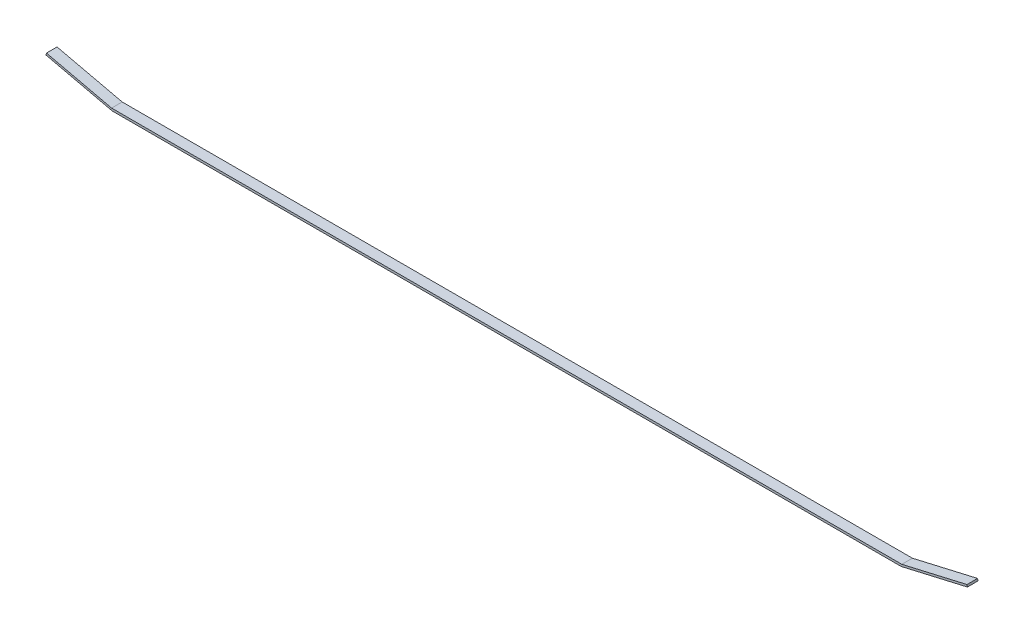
from build123d import *

# Parameters (mm, degrees)
BOSS_EXTRUDE1_DEPTH = 7


with BuildPart() as part:
    # Sketch1 → Boss-Extrude1 (new body)
    with BuildSketch(Plane.XY):
        Polygon((-261, -4.251481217), (-261.389497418, -4.251481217), (-304.499318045, 5.71198211), (-304.8, 4.410994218), (-261, -5.71198211), (261, -5.71198211), (261, -4.251481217), align=None)
        Polygon((261, -4.251481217), (261, -5.71198211), (304.8, 4.410994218), (304.499318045, 5.71198211), (261.389497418, -4.251481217), align=None)
    extrude(amount=BOSS_EXTRUDE1_DEPTH)


solid = part.part
